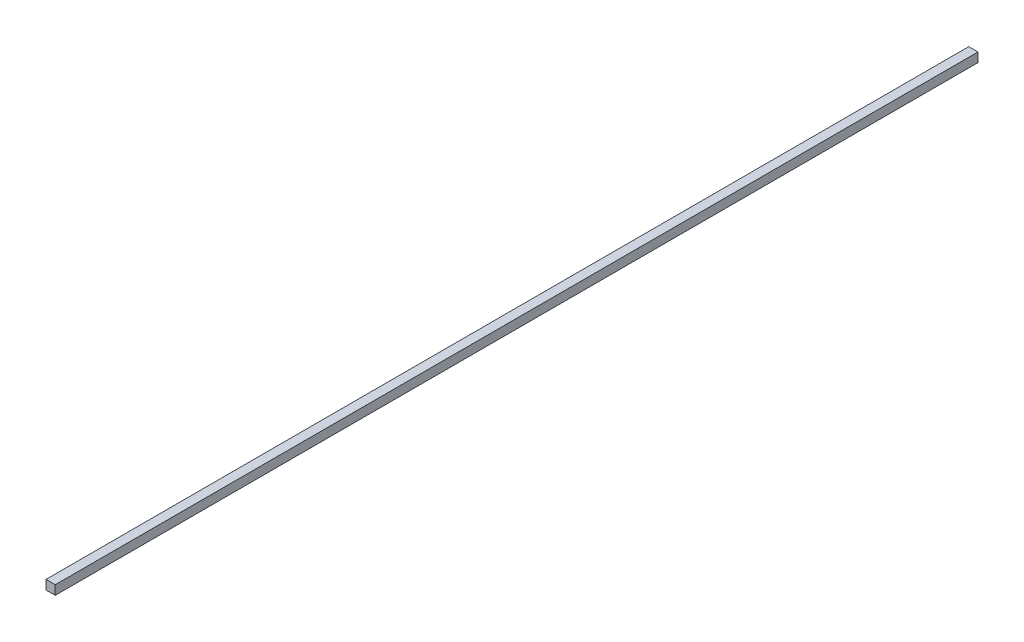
ISO-10303-21;
HEADER;
FILE_DESCRIPTION(('STEP AP214'),'2;1');
FILE_NAME('part.step','',(''),(''),'','','');
FILE_SCHEMA(('AUTOMOTIVE_DESIGN { 1 0 10303 214 1 1 1 1 }'));
ENDSEC;
DATA;
#1=APPLICATION_CONTEXT('core data for automotive mechanical design processes');
#2=APPLICATION_PROTOCOL_DEFINITION('international standard','automotive_design',2000,#1);
#3=PRODUCT_CONTEXT('',#1,'mechanical');
#4=PRODUCT('Part','Part','',(#3));
#5=PRODUCT_RELATED_PRODUCT_CATEGORY('part','',(#4));
#6=PRODUCT_DEFINITION_FORMATION('','',#4);
#7=PRODUCT_DEFINITION_CONTEXT('part definition',#1,'design');
#8=PRODUCT_DEFINITION('design','',#6,#7);
#9=PRODUCT_DEFINITION_SHAPE('','',#8);
#10=(LENGTH_UNIT() NAMED_UNIT(*) SI_UNIT(.MILLI.,.METRE.));
#11=(NAMED_UNIT(*) PLANE_ANGLE_UNIT() SI_UNIT($,.RADIAN.));
#12=(NAMED_UNIT(*) SI_UNIT($,.STERADIAN.) SOLID_ANGLE_UNIT());
#13=UNCERTAINTY_MEASURE_WITH_UNIT(LENGTH_MEASURE(1.E-05),#10,'distance_accuracy_value','');
#14=(GEOMETRIC_REPRESENTATION_CONTEXT(3) GLOBAL_UNCERTAINTY_ASSIGNED_CONTEXT((#13)) GLOBAL_UNIT_ASSIGNED_CONTEXT((#10,
#11,#12)) REPRESENTATION_CONTEXT('',''));
#15=CARTESIAN_POINT('',(0.,0.,0.));
#16=DIRECTION('',(0.,0.,1.));
#17=DIRECTION('',(1.,0.,0.));
#18=AXIS2_PLACEMENT_3D('',#15,#16,#17);
#19=CARTESIAN_POINT('',(-1.,1.,100.));
#20=DIRECTION('',(1.,0.,0.));
#21=DIRECTION('',(0.,0.,-1.));
#22=AXIS2_PLACEMENT_3D('',#19,#20,#21);
#23=PLANE('',#22);
#24=DIRECTION('',(0.,-1.,0.));
#25=VECTOR('',#24,1.);
#26=CARTESIAN_POINT('',(-1.,1.,-100.));
#27=LINE('',#26,#25);
#28=CARTESIAN_POINT('',(-1.,1.,-100.));
#29=VERTEX_POINT('',#28);
#30=CARTESIAN_POINT('',(-1.,-1.,-100.));
#31=VERTEX_POINT('',#30);
#32=EDGE_CURVE('E70',#29,#31,#27,.T.);
#33=ORIENTED_EDGE('',*,*,#32,.T.);
#34=DIRECTION('',(0.,0.,-1.));
#35=VECTOR('',#34,1.);
#36=CARTESIAN_POINT('',(-1.,-1.,100.));
#37=LINE('',#36,#35);
#38=CARTESIAN_POINT('',(-1.,-1.,100.));
#39=VERTEX_POINT('',#38);
#40=EDGE_CURVE('E11',#39,#31,#37,.T.);
#41=ORIENTED_EDGE('',*,*,#40,.F.);
#42=DIRECTION('',(0.,-1.,0.));
#43=VECTOR('',#42,1.);
#44=CARTESIAN_POINT('',(-1.,1.,100.));
#45=LINE('',#44,#43);
#46=CARTESIAN_POINT('',(-1.,1.,100.));
#47=VERTEX_POINT('',#46);
#48=EDGE_CURVE('E88',#47,#39,#45,.T.);
#49=ORIENTED_EDGE('',*,*,#48,.F.);
#50=DIRECTION('',(0.,0.,-1.));
#51=VECTOR('',#50,1.);
#52=CARTESIAN_POINT('',(-1.,1.,100.));
#53=LINE('',#52,#51);
#54=EDGE_CURVE('E82',#47,#29,#53,.T.);
#55=ORIENTED_EDGE('',*,*,#54,.T.);
#56=EDGE_LOOP('',(#33,#41,#49,#55));
#57=FACE_BOUND('',#56,.T.);
#58=ADVANCED_FACE('F26',(#57),#23,.F.);
#59=CARTESIAN_POINT('',(-1.,-1.,100.));
#60=DIRECTION('',(0.,1.,0.));
#61=DIRECTION('',(0.,0.,1.));
#62=AXIS2_PLACEMENT_3D('',#59,#60,#61);
#63=PLANE('',#62);
#64=DIRECTION('',(1.,0.,0.));
#65=VECTOR('',#64,1.);
#66=CARTESIAN_POINT('',(-1.,-1.,-100.));
#67=LINE('',#66,#65);
#68=CARTESIAN_POINT('',(1.,-1.,-100.));
#69=VERTEX_POINT('',#68);
#70=EDGE_CURVE('E66',#31,#69,#67,.T.);
#71=ORIENTED_EDGE('',*,*,#70,.T.);
#72=DIRECTION('',(0.,0.,-1.));
#73=VECTOR('',#72,1.);
#74=CARTESIAN_POINT('',(1.,-1.,100.));
#75=LINE('',#74,#73);
#76=CARTESIAN_POINT('',(1.,-1.,100.));
#77=VERTEX_POINT('',#76);
#78=EDGE_CURVE('E33',#77,#69,#75,.T.);
#79=ORIENTED_EDGE('',*,*,#78,.F.);
#80=DIRECTION('',(1.,0.,0.));
#81=VECTOR('',#80,1.);
#82=CARTESIAN_POINT('',(-1.,-1.,100.));
#83=LINE('',#82,#81);
#84=EDGE_CURVE('E78',#39,#77,#83,.T.);
#85=ORIENTED_EDGE('',*,*,#84,.F.);
#86=ORIENTED_EDGE('',*,*,#40,.T.);
#87=EDGE_LOOP('',(#71,#79,#85,#86));
#88=FACE_BOUND('',#87,.T.);
#89=ADVANCED_FACE('F77',(#88),#63,.F.);
#90=CARTESIAN_POINT('',(1.,1.,100.));
#91=DIRECTION('',(-1.,0.,0.));
#92=DIRECTION('',(0.,-1.,0.));
#93=AXIS2_PLACEMENT_3D('',#90,#91,#92);
#94=PLANE('',#93);
#95=DIRECTION('',(0.,1.,0.));
#96=VECTOR('',#95,1.);
#97=CARTESIAN_POINT('',(1.,1.,-100.));
#98=LINE('',#97,#96);
#99=CARTESIAN_POINT('',(1.,1.,-100.));
#100=VERTEX_POINT('',#99);
#101=EDGE_CURVE('E71',#69,#100,#98,.T.);
#102=ORIENTED_EDGE('',*,*,#101,.T.);
#103=DIRECTION('',(0.,0.,-1.));
#104=VECTOR('',#103,1.);
#105=CARTESIAN_POINT('',(1.,1.,100.));
#106=LINE('',#105,#104);
#107=CARTESIAN_POINT('',(1.,1.,100.));
#108=VERTEX_POINT('',#107);
#109=EDGE_CURVE('E94',#108,#100,#106,.T.);
#110=ORIENTED_EDGE('',*,*,#109,.F.);
#111=DIRECTION('',(0.,1.,0.));
#112=VECTOR('',#111,1.);
#113=CARTESIAN_POINT('',(1.,1.,100.));
#114=LINE('',#113,#112);
#115=EDGE_CURVE('E45',#77,#108,#114,.T.);
#116=ORIENTED_EDGE('',*,*,#115,.F.);
#117=ORIENTED_EDGE('',*,*,#78,.T.);
#118=EDGE_LOOP('',(#102,#110,#116,#117));
#119=FACE_BOUND('',#118,.T.);
#120=ADVANCED_FACE('F97',(#119),#94,.F.);
#121=CARTESIAN_POINT('',(-1.,1.,100.));
#122=DIRECTION('',(0.,-1.,0.));
#123=DIRECTION('',(1.,0.,0.));
#124=AXIS2_PLACEMENT_3D('',#121,#122,#123);
#125=PLANE('',#124);
#126=DIRECTION('',(-1.,0.,0.));
#127=VECTOR('',#126,1.);
#128=CARTESIAN_POINT('',(-1.,1.,-100.));
#129=LINE('',#128,#127);
#130=EDGE_CURVE('E86',#100,#29,#129,.T.);
#131=ORIENTED_EDGE('',*,*,#130,.T.);
#132=ORIENTED_EDGE('',*,*,#54,.F.);
#133=DIRECTION('',(-1.,0.,0.));
#134=VECTOR('',#133,1.);
#135=CARTESIAN_POINT('',(-1.,1.,100.));
#136=LINE('',#135,#134);
#137=EDGE_CURVE('E40',#108,#47,#136,.T.);
#138=ORIENTED_EDGE('',*,*,#137,.F.);
#139=ORIENTED_EDGE('',*,*,#109,.T.);
#140=EDGE_LOOP('',(#131,#132,#138,#139));
#141=FACE_BOUND('',#140,.T.);
#142=ADVANCED_FACE('F99',(#141),#125,.F.);
#143=CARTESIAN_POINT('',(-1.,-1.,100.));
#144=DIRECTION('',(0.,0.,1.));
#145=DIRECTION('',(1.,0.,0.));
#146=AXIS2_PLACEMENT_3D('',#143,#144,#145);
#147=PLANE('',#146);
#148=ORIENTED_EDGE('',*,*,#48,.T.);
#149=ORIENTED_EDGE('',*,*,#84,.T.);
#150=ORIENTED_EDGE('',*,*,#115,.T.);
#151=ORIENTED_EDGE('',*,*,#137,.T.);
#152=EDGE_LOOP('',(#148,#149,#150,#151));
#153=FACE_BOUND('',#152,.T.);
#154=ADVANCED_FACE('F100',(#153),#147,.T.);
#155=CARTESIAN_POINT('',(-1.,-1.,-100.));
#156=DIRECTION('',(0.,0.,1.));
#157=DIRECTION('',(1.,0.,0.));
#158=AXIS2_PLACEMENT_3D('',#155,#156,#157);
#159=PLANE('',#158);
#160=ORIENTED_EDGE('',*,*,#32,.F.);
#161=ORIENTED_EDGE('',*,*,#130,.F.);
#162=ORIENTED_EDGE('',*,*,#101,.F.);
#163=ORIENTED_EDGE('',*,*,#70,.F.);
#164=EDGE_LOOP('',(#160,#161,#162,#163));
#165=FACE_BOUND('',#164,.T.);
#166=ADVANCED_FACE('F67',(#165),#159,.F.);
#167=CLOSED_SHELL('',(#58,#89,#120,#142,#154,#166));
#168=MANIFOLD_SOLID_BREP('B2',#167);
#169=ADVANCED_BREP_SHAPE_REPRESENTATION('',(#18,#168),#14);
#170=SHAPE_DEFINITION_REPRESENTATION(#9,#169);
ENDSEC;
END-ISO-10303-21;
